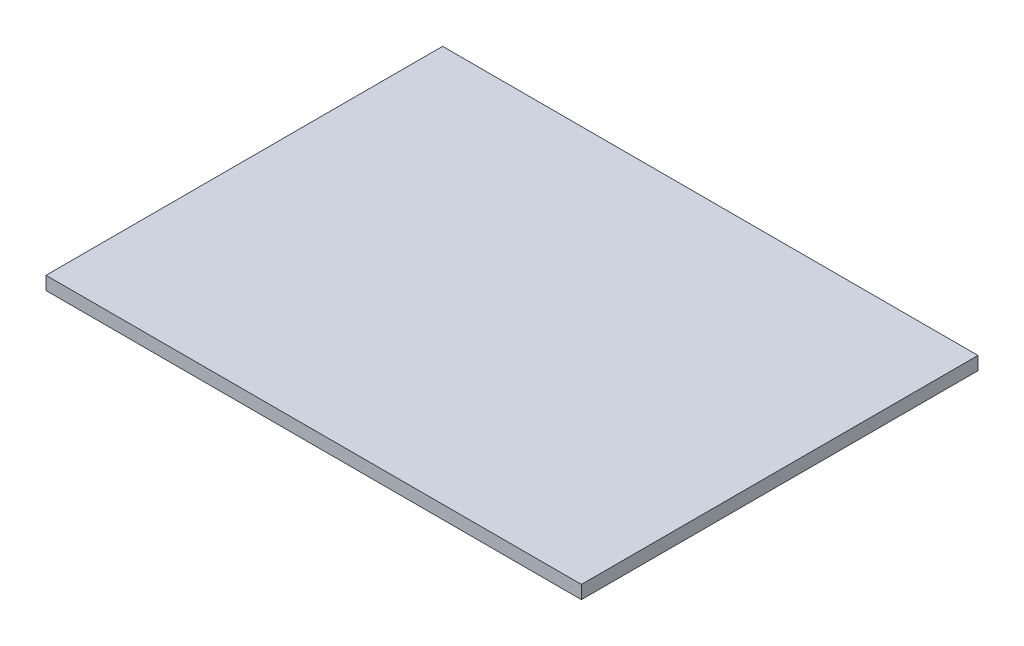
from build123d import *

# Parameters (mm, degrees)
SKETCH1_W           = 40.5
SKETCH1_H           = 30
BOSS_EXTRUDE1_DEPTH = 0.5


with BuildPart() as part:
    # Sketch1 → Boss-Extrude1 (new, symmetric)
    with BuildSketch(Plane(origin=(0, 0, 0), x_dir=(1, 0, 0), z_dir=(0, 1, 0))):
        Rectangle(SKETCH1_W, SKETCH1_H)
    extrude(amount=BOSS_EXTRUDE1_DEPTH, both=True)


solid = part.part
